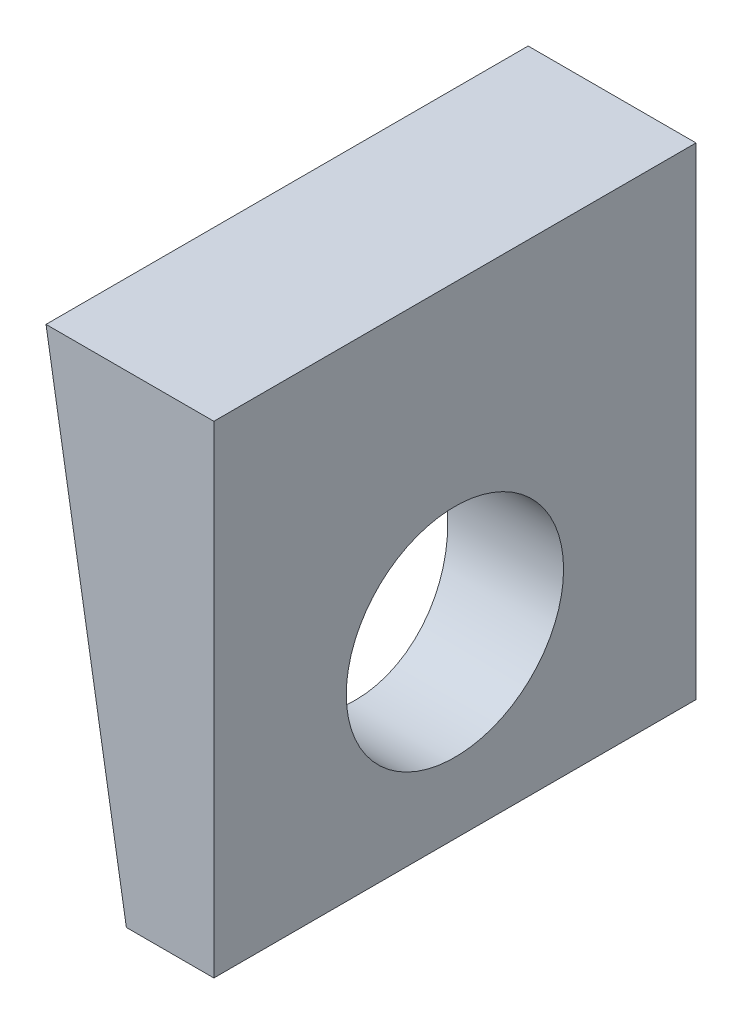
ISO-10303-21;
HEADER;
FILE_DESCRIPTION(('STEP AP214'),'2;1');
FILE_NAME('part.step','',(''),(''),'','','');
FILE_SCHEMA(('AUTOMOTIVE_DESIGN { 1 0 10303 214 1 1 1 1 }'));
ENDSEC;
DATA;
#1=APPLICATION_CONTEXT('core data for automotive mechanical design processes');
#2=APPLICATION_PROTOCOL_DEFINITION('international standard','automotive_design',2000,#1);
#3=PRODUCT_CONTEXT('',#1,'mechanical');
#4=PRODUCT('Part','Part','',(#3));
#5=PRODUCT_RELATED_PRODUCT_CATEGORY('part','',(#4));
#6=PRODUCT_DEFINITION_FORMATION('','',#4);
#7=PRODUCT_DEFINITION_CONTEXT('part definition',#1,'design');
#8=PRODUCT_DEFINITION('design','',#6,#7);
#9=PRODUCT_DEFINITION_SHAPE('','',#8);
#10=(LENGTH_UNIT() NAMED_UNIT(*) SI_UNIT(.MILLI.,.METRE.));
#11=(NAMED_UNIT(*) PLANE_ANGLE_UNIT() SI_UNIT($,.RADIAN.));
#12=(NAMED_UNIT(*) SI_UNIT($,.STERADIAN.) SOLID_ANGLE_UNIT());
#13=UNCERTAINTY_MEASURE_WITH_UNIT(LENGTH_MEASURE(1.E-05),#10,'distance_accuracy_value','');
#14=(GEOMETRIC_REPRESENTATION_CONTEXT(3) GLOBAL_UNCERTAINTY_ASSIGNED_CONTEXT((#13)) GLOBAL_UNIT_ASSIGNED_CONTEXT((#10,
#11,#12)) REPRESENTATION_CONTEXT('',''));
#15=CARTESIAN_POINT('',(0.,0.,0.));
#16=DIRECTION('',(0.,0.,1.));
#17=DIRECTION('',(1.,0.,0.));
#18=AXIS2_PLACEMENT_3D('',#15,#16,#17);
#19=CARTESIAN_POINT('',(-5.43094333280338,-14.96314,14.96314));
#20=DIRECTION('',(0.986393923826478,0.164398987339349,0.));
#21=DIRECTION('',(-0.164398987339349,0.986393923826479,0.));
#22=AXIS2_PLACEMENT_3D('',#19,#20,#21);
#23=PLANE('',#22);
#24=CARTESIAN_POINT('',(-7.28514333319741,-3.83794,0.));
#25=DIRECTION('',(0.986393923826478,0.164398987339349,0.));
#26=DIRECTION('',(0.164398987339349,-0.986393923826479,0.));
#27=AXIS2_PLACEMENT_3D('',#24,#25,#26);
#28=ELLIPSE('',#27,6.83672094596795,6.7437);
#29=CARTESIAN_POINT('',(-6.16119333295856,-10.58164,0.));
#30=VERTEX_POINT('',#29);
#31=EDGE_CURVE('E105',#30,#30,#28,.T.);
#32=ORIENTED_EDGE('',*,*,#31,.T.);
#33=EDGE_LOOP('',(#32));
#34=FACE_BOUND('',#33,.T.);
#35=DIRECTION('',(0.164398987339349,-0.986393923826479,0.));
#36=VECTOR('',#35,1.);
#37=CARTESIAN_POINT('',(-5.43094333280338,-14.96314,-14.96314));
#38=LINE('',#37,#36);
#39=CARTESIAN_POINT('',(-10.4186566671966,14.96314,-14.96314));
#40=VERTEX_POINT('',#39);
#41=CARTESIAN_POINT('',(-5.43094333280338,-14.96314,-14.96314));
#42=VERTEX_POINT('',#41);
#43=EDGE_CURVE('E102',#40,#42,#38,.T.);
#44=ORIENTED_EDGE('',*,*,#43,.T.);
#45=DIRECTION('',(0.,0.,-1.));
#46=VECTOR('',#45,1.);
#47=CARTESIAN_POINT('',(-5.43094333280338,-14.96314,14.96314));
#48=LINE('',#47,#46);
#49=CARTESIAN_POINT('',(-5.43094333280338,-14.96314,14.96314));
#50=VERTEX_POINT('',#49);
#51=EDGE_CURVE('E11',#50,#42,#48,.T.);
#52=ORIENTED_EDGE('',*,*,#51,.F.);
#53=DIRECTION('',(0.164398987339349,-0.986393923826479,0.));
#54=VECTOR('',#53,1.);
#55=CARTESIAN_POINT('',(-5.43094333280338,-14.96314,14.96314));
#56=LINE('',#55,#54);
#57=CARTESIAN_POINT('',(-10.4186566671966,14.96314,14.96314));
#58=VERTEX_POINT('',#57);
#59=EDGE_CURVE('E90',#58,#50,#56,.T.);
#60=ORIENTED_EDGE('',*,*,#59,.F.);
#61=DIRECTION('',(0.,0.,-1.));
#62=VECTOR('',#61,1.);
#63=CARTESIAN_POINT('',(-10.4186566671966,14.96314,14.96314));
#64=LINE('',#63,#62);
#65=EDGE_CURVE('E98',#58,#40,#64,.T.);
#66=ORIENTED_EDGE('',*,*,#65,.T.);
#67=EDGE_LOOP('',(#44,#52,#60,#66));
#68=FACE_BOUND('',#67,.T.);
#69=ADVANCED_FACE('F39',(#34,#68),#23,.F.);
#70=CARTESIAN_POINT('',(-5.43094333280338,-14.96314,14.96314));
#71=DIRECTION('',(0.,1.,0.));
#72=DIRECTION('',(0.,0.,1.));
#73=AXIS2_PLACEMENT_3D('',#70,#71,#72);
#74=PLANE('',#73);
#75=DIRECTION('',(1.,0.,0.));
#76=VECTOR('',#75,1.);
#77=CARTESIAN_POINT('',(-5.43094333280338,-14.96314,-14.96314));
#78=LINE('',#77,#76);
#79=CARTESIAN_POINT('',(0.,-14.96314,-14.96314));
#80=VERTEX_POINT('',#79);
#81=EDGE_CURVE('E94',#42,#80,#78,.T.);
#82=ORIENTED_EDGE('',*,*,#81,.T.);
#83=DIRECTION('',(0.,0.,-1.));
#84=VECTOR('',#83,1.);
#85=CARTESIAN_POINT('',(0.,-14.96314,14.96314));
#86=LINE('',#85,#84);
#87=CARTESIAN_POINT('',(0.,-14.96314,14.96314));
#88=VERTEX_POINT('',#87);
#89=EDGE_CURVE('E47',#88,#80,#86,.T.);
#90=ORIENTED_EDGE('',*,*,#89,.F.);
#91=DIRECTION('',(1.,0.,0.));
#92=VECTOR('',#91,1.);
#93=CARTESIAN_POINT('',(-5.43094333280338,-14.96314,14.96314));
#94=LINE('',#93,#92);
#95=EDGE_CURVE('E85',#50,#88,#94,.T.);
#96=ORIENTED_EDGE('',*,*,#95,.F.);
#97=ORIENTED_EDGE('',*,*,#51,.T.);
#98=EDGE_LOOP('',(#82,#90,#96,#97));
#99=FACE_BOUND('',#98,.T.);
#100=ADVANCED_FACE('F93',(#99),#74,.F.);
#101=CARTESIAN_POINT('',(0.,-14.96314,14.96314));
#102=DIRECTION('',(-1.,0.,0.));
#103=DIRECTION('',(0.,-1.,0.));
#104=AXIS2_PLACEMENT_3D('',#101,#102,#103);
#105=PLANE('',#104);
#106=CARTESIAN_POINT('',(0.,-3.83794,0.));
#107=DIRECTION('',(1.,0.,0.));
#108=DIRECTION('',(0.,0.,-1.));
#109=AXIS2_PLACEMENT_3D('',#106,#107,#108);
#110=CIRCLE('',#109,6.7437);
#111=CARTESIAN_POINT('',(0.,-3.83794,-6.7437));
#112=VERTEX_POINT('',#111);
#113=EDGE_CURVE('E118',#112,#112,#110,.T.);
#114=ORIENTED_EDGE('',*,*,#113,.F.);
#115=EDGE_LOOP('',(#114));
#116=FACE_BOUND('',#115,.T.);
#117=DIRECTION('',(0.,1.,0.));
#118=VECTOR('',#117,1.);
#119=CARTESIAN_POINT('',(0.,-14.96314,-14.96314));
#120=LINE('',#119,#118);
#121=CARTESIAN_POINT('',(0.,14.96314,-14.96314));
#122=VERTEX_POINT('',#121);
#123=EDGE_CURVE('E72',#80,#122,#120,.T.);
#124=ORIENTED_EDGE('',*,*,#123,.T.);
#125=DIRECTION('',(0.,0.,-1.));
#126=VECTOR('',#125,1.);
#127=CARTESIAN_POINT('',(0.,14.96314,14.96314));
#128=LINE('',#127,#126);
#129=CARTESIAN_POINT('',(0.,14.96314,14.96314));
#130=VERTEX_POINT('',#129);
#131=EDGE_CURVE('E95',#130,#122,#128,.T.);
#132=ORIENTED_EDGE('',*,*,#131,.F.);
#133=DIRECTION('',(0.,1.,0.));
#134=VECTOR('',#133,1.);
#135=CARTESIAN_POINT('',(0.,-14.96314,14.96314));
#136=LINE('',#135,#134);
#137=EDGE_CURVE('E88',#88,#130,#136,.T.);
#138=ORIENTED_EDGE('',*,*,#137,.F.);
#139=ORIENTED_EDGE('',*,*,#89,.T.);
#140=EDGE_LOOP('',(#124,#132,#138,#139));
#141=FACE_BOUND('',#140,.T.);
#142=ADVANCED_FACE('F96',(#116,#141),#105,.F.);
#143=CARTESIAN_POINT('',(0.,14.96314,14.96314));
#144=DIRECTION('',(0.,-1.,0.));
#145=DIRECTION('',(1.,0.,0.));
#146=AXIS2_PLACEMENT_3D('',#143,#144,#145);
#147=PLANE('',#146);
#148=DIRECTION('',(-1.,0.,0.));
#149=VECTOR('',#148,1.);
#150=CARTESIAN_POINT('',(0.,14.96314,-14.96314));
#151=LINE('',#150,#149);
#152=EDGE_CURVE('E78',#122,#40,#151,.T.);
#153=ORIENTED_EDGE('',*,*,#152,.T.);
#154=ORIENTED_EDGE('',*,*,#65,.F.);
#155=DIRECTION('',(-1.,0.,0.));
#156=VECTOR('',#155,1.);
#157=CARTESIAN_POINT('',(0.,14.96314,14.96314));
#158=LINE('',#157,#156);
#159=EDGE_CURVE('E55',#130,#58,#158,.T.);
#160=ORIENTED_EDGE('',*,*,#159,.F.);
#161=ORIENTED_EDGE('',*,*,#131,.T.);
#162=EDGE_LOOP('',(#153,#154,#160,#161));
#163=FACE_BOUND('',#162,.T.);
#164=ADVANCED_FACE('F110',(#163),#147,.F.);
#165=CARTESIAN_POINT('',(0.,0.,14.96314));
#166=DIRECTION('',(0.,0.,1.));
#167=DIRECTION('',(1.,0.,0.));
#168=AXIS2_PLACEMENT_3D('',#165,#166,#167);
#169=PLANE('',#168);
#170=ORIENTED_EDGE('',*,*,#59,.T.);
#171=ORIENTED_EDGE('',*,*,#95,.T.);
#172=ORIENTED_EDGE('',*,*,#137,.T.);
#173=ORIENTED_EDGE('',*,*,#159,.T.);
#174=EDGE_LOOP('',(#170,#171,#172,#173));
#175=FACE_BOUND('',#174,.T.);
#176=ADVANCED_FACE('F86',(#175),#169,.T.);
#177=CARTESIAN_POINT('',(0.,0.,-14.96314));
#178=DIRECTION('',(0.,0.,1.));
#179=DIRECTION('',(1.,0.,0.));
#180=AXIS2_PLACEMENT_3D('',#177,#178,#179);
#181=PLANE('',#180);
#182=ORIENTED_EDGE('',*,*,#43,.F.);
#183=ORIENTED_EDGE('',*,*,#152,.F.);
#184=ORIENTED_EDGE('',*,*,#123,.F.);
#185=ORIENTED_EDGE('',*,*,#81,.F.);
#186=EDGE_LOOP('',(#182,#183,#184,#185));
#187=FACE_BOUND('',#186,.T.);
#188=ADVANCED_FACE('F113',(#187),#181,.F.);
#189=CARTESIAN_POINT('',(-10.4186566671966,-3.83794,0.));
#190=DIRECTION('',(1.,0.,0.));
#191=DIRECTION('',(0.,0.,-1.));
#192=AXIS2_PLACEMENT_3D('',#189,#190,#191);
#193=CYLINDRICAL_SURFACE('',#192,6.7437);
#194=ORIENTED_EDGE('',*,*,#113,.T.);
#195=EDGE_LOOP('',(#194));
#196=FACE_BOUND('',#195,.T.);
#197=ORIENTED_EDGE('',*,*,#31,.F.);
#198=EDGE_LOOP('',(#197));
#199=FACE_BOUND('',#198,.T.);
#200=ADVANCED_FACE('F122',(#196,#199),#193,.F.);
#201=CLOSED_SHELL('',(#69,#100,#142,#164,#176,#188,#200));
#202=MANIFOLD_SOLID_BREP('B2',#201);
#203=ADVANCED_BREP_SHAPE_REPRESENTATION('',(#18,#202),#14);
#204=SHAPE_DEFINITION_REPRESENTATION(#9,#203);
ENDSEC;
END-ISO-10303-21;
